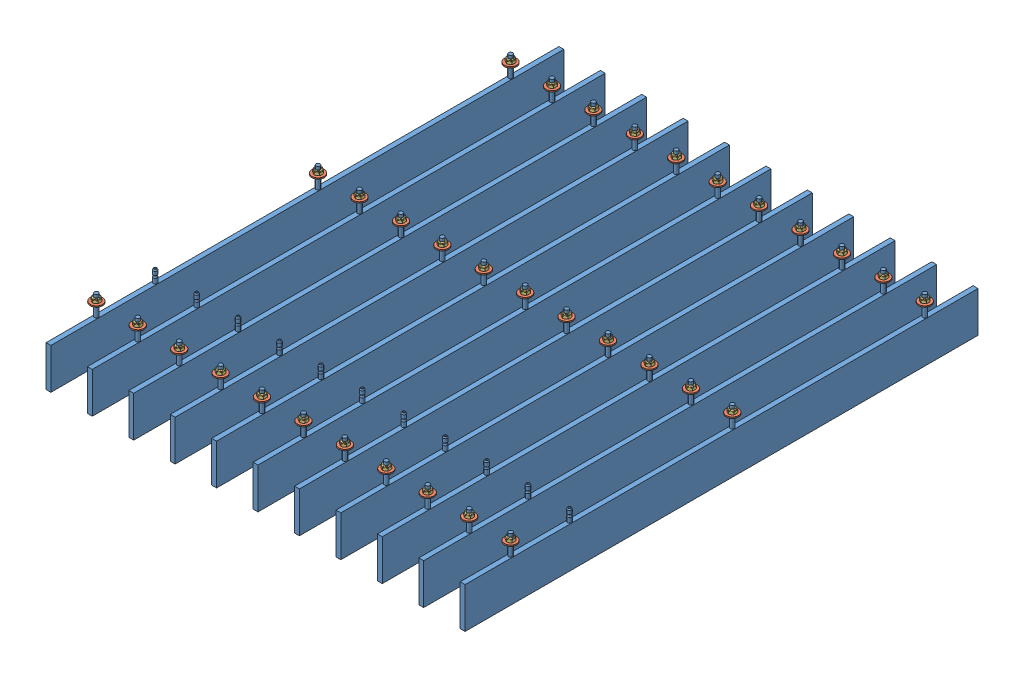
SolidWorks assembly Ensemble coussin.SLDASM, configuration Défaut (file format 4100). Lengths in mm.
Overall size (1050 150 1263).
77 component instances, 3 part files, 11 mates.
Components (placement in the parent):
- Coussin-1: Coussin.SLDPRT [Défaut] at origin size (12 150 1263)
- Rondelle M10 serie Large-1: Rondelle M10 serie Large.SLDPRT [Défaut] at (0 133 125) x (0 0 1) z (0 -1 0) size (30 30 3)
- Rondelle M10 serie Large-2: Rondelle M10 serie Large.SLDPRT [Défaut] at (0 133 599) x (0 0 1) z (0 -1 0) size (30 30 3)
- Rondelle M10 serie Large-3: Rondelle M10 serie Large.SLDPRT [Défaut] at (0 133 1145) x (0 0 1) z (0 -1 0) size (30 30 3)
- Ecrou bague nylon 10-1: Ecrou bague nylon 10.sldprt [Défaut] at (0 133 1145) x (0 1 0) z (-1 0 0) size (10 19.63 17)
- Ecrou bague nylon 10-2: Ecrou bague nylon 10.sldprt [Défaut] at (0 133 599) x (0 1 0) z (-1 0 0) size (10 19.63 17)
- Ecrou bague nylon 10-3: Ecrou bague nylon 10.sldprt [Défaut] at (0 133 125) x (0 1 0) z (-1 0 0) size (10 19.63 17)
- Ecrou bague nylon 10-4: Ecrou bague nylon 10.sldprt [Défaut] at (102 133 125) x (0 1 0) z (-1 0 0) size (10 19.63 17)
- Ecrou bague nylon 10-5: Ecrou bague nylon 10.sldprt [Défaut] at (204 133 125) x (0 1 0) z (-1 0 0) size (10 19.63 17)
- Ecrou bague nylon 10-6: Ecrou bague nylon 10.sldprt [Défaut] at (306 133 125) x (0 1 0) z (-1 0 0) size (10 19.63 17)
- Ecrou bague nylon 10-7: Ecrou bague nylon 10.sldprt [Défaut] at (408 133 125) x (0 1 0) z (-1 0 0) size (10 19.63 17)
- Ecrou bague nylon 10-8: Ecrou bague nylon 10.sldprt [Défaut] at (510 133 125) x (0 1 0) z (-1 0 0) size (10 19.63 17)
- Ecrou bague nylon 10-9: Ecrou bague nylon 10.sldprt [Défaut] at (612 133 125) x (0 1 0) z (-1 0 0) size (10 19.63 17)
- Ecrou bague nylon 10-10: Ecrou bague nylon 10.sldprt [Défaut] at (714 133 125) x (0 1 0) z (-1 0 0) size (10 19.63 17)
- Ecrou bague nylon 10-11: Ecrou bague nylon 10.sldprt [Défaut] at (816 133 125) x (0 1 0) z (-1 0 0) size (10 19.63 17)
- Ecrou bague nylon 10-12: Ecrou bague nylon 10.sldprt [Défaut] at (918 133 125) x (0 1 0) z (-1 0 0) size (10 19.63 17)
- Ecrou bague nylon 10-13: Ecrou bague nylon 10.sldprt [Défaut] at (1020 133 125) x (0 1 0) z (-1 0 0) size (10 19.63 17)
- Ecrou bague nylon 10-14: Ecrou bague nylon 10.sldprt [Défaut] at (102 133 599) x (0 1 0) z (-1 0 0) size (10 19.63 17)
- Ecrou bague nylon 10-15: Ecrou bague nylon 10.sldprt [Défaut] at (204 133 599) x (0 1 0) z (-1 0 0) size (10 19.63 17)
- Ecrou bague nylon 10-16: Ecrou bague nylon 10.sldprt [Défaut] at (306 133 599) x (0 1 0) z (-1 0 0) size (10 19.63 17)
- Ecrou bague nylon 10-17: Ecrou bague nylon 10.sldprt [Défaut] at (408 133 599) x (0 1 0) z (-1 0 0) size (10 19.63 17)
- Ecrou bague nylon 10-18: Ecrou bague nylon 10.sldprt [Défaut] at (510 133 599) x (0 1 0) z (-1 0 0) size (10 19.63 17)
- Ecrou bague nylon 10-19: Ecrou bague nylon 10.sldprt [Défaut] at (612 133 599) x (0 1 0) z (-1 0 0) size (10 19.63 17)
- Ecrou bague nylon 10-20: Ecrou bague nylon 10.sldprt [Défaut] at (714 133 599) x (0 1 0) z (-1 0 0) size (10 19.63 17)
- Ecrou bague nylon 10-21: Ecrou bague nylon 10.sldprt [Défaut] at (816 133 599) x (0 1 0) z (-1 0 0) size (10 19.63 17)
- Ecrou bague nylon 10-22: Ecrou bague nylon 10.sldprt [Défaut] at (918 133 599) x (0 1 0) z (-1 0 0) size (10 19.63 17)
- Ecrou bague nylon 10-23: Ecrou bague nylon 10.sldprt [Défaut] at (1020 133 599) x (0 1 0) z (-1 0 0) size (10 19.63 17)
- Ecrou bague nylon 10-24: Ecrou bague nylon 10.sldprt [Défaut] at (102 133 1145) x (0 1 0) z (-1 0 0) size (10 19.63 17)
- Ecrou bague nylon 10-25: Ecrou bague nylon 10.sldprt [Défaut] at (204 133 1145) x (0 1 0) z (-1 0 0) size (10 19.63 17)
- Ecrou bague nylon 10-26: Ecrou bague nylon 10.sldprt [Défaut] at (306 133 1145) x (0 1 0) z (-1 0 0) size (10 19.63 17)
- Ecrou bague nylon 10-27: Ecrou bague nylon 10.sldprt [Défaut] at (408 133 1145) x (0 1 0) z (-1 0 0) size (10 19.63 17)
- Ecrou bague nylon 10-28: Ecrou bague nylon 10.sldprt [Défaut] at (510 133 1145) x (0 1 0) z (-1 0 0) size (10 19.63 17)
- Ecrou bague nylon 10-29: Ecrou bague nylon 10.sldprt [Défaut] at (612 133 1145) x (0 1 0) z (-1 0 0) size (10 19.63 17)
- Ecrou bague nylon 10-30: Ecrou bague nylon 10.sldprt [Défaut] at (714 133 1145) x (0 1 0) z (-1 0 0) size (10 19.63 17)
- Ecrou bague nylon 10-31: Ecrou bague nylon 10.sldprt [Défaut] at (816 133 1145) x (0 1 0) z (-1 0 0) size (10 19.63 17)
- Ecrou bague nylon 10-32: Ecrou bague nylon 10.sldprt [Défaut] at (918 133 1145) x (0 1 0) z (-1 0 0) size (10 19.63 17)
- Ecrou bague nylon 10-33: Ecrou bague nylon 10.sldprt [Défaut] at (1020 133 1145) x (0 1 0) z (-1 0 0) size (10 19.63 17)
- Rondelle M10 serie Large-4: Rondelle M10 serie Large.SLDPRT [Défaut] at (102 133 1145) x (0 0 1) z (0 -1 0) size (30 30 3)
- Rondelle M10 serie Large-5: Rondelle M10 serie Large.SLDPRT [Défaut] at (204 133 1145) x (0 0 1) z (0 -1 0) size (30 30 3)
- Rondelle M10 serie Large-6: Rondelle M10 serie Large.SLDPRT [Défaut] at (306 133 1145) x (0 0 1) z (0 -1 0) size (30 30 3)
- Rondelle M10 serie Large-7: Rondelle M10 serie Large.SLDPRT [Défaut] at (408 133 1145) x (0 0 1) z (0 -1 0) size (30 30 3)
- Rondelle M10 serie Large-8: Rondelle M10 serie Large.SLDPRT [Défaut] at (510 133 1145) x (0 0 1) z (0 -1 0) size (30 30 3)
- Rondelle M10 serie Large-9: Rondelle M10 serie Large.SLDPRT [Défaut] at (612 133 1145) x (0 0 1) z (0 -1 0) size (30 30 3)
- Rondelle M10 serie Large-10: Rondelle M10 serie Large.SLDPRT [Défaut] at (714 133 1145) x (0 0 1) z (0 -1 0) size (30 30 3)
- Rondelle M10 serie Large-11: Rondelle M10 serie Large.SLDPRT [Défaut] at (816 133 1145) x (0 0 1) z (0 -1 0) size (30 30 3)
- Rondelle M10 serie Large-12: Rondelle M10 serie Large.SLDPRT [Défaut] at (918 133 1145) x (0 0 1) z (0 -1 0) size (30 30 3)
- Rondelle M10 serie Large-13: Rondelle M10 serie Large.SLDPRT [Défaut] at (1020 133 1145) x (0 0 1) z (0 -1 0) size (30 30 3)
- Rondelle M10 serie Large-14: Rondelle M10 serie Large.SLDPRT [Défaut] at (102 133 599) x (0 0 1) z (0 -1 0) size (30 30 3)
- Rondelle M10 serie Large-15: Rondelle M10 serie Large.SLDPRT [Défaut] at (204 133 599) x (0 0 1) z (0 -1 0) size (30 30 3)
- Rondelle M10 serie Large-16: Rondelle M10 serie Large.SLDPRT [Défaut] at (306 133 599) x (0 0 1) z (0 -1 0) size (30 30 3)
- Rondelle M10 serie Large-17: Rondelle M10 serie Large.SLDPRT [Défaut] at (408 133 599) x (0 0 1) z (0 -1 0) size (30 30 3)
- Rondelle M10 serie Large-18: Rondelle M10 serie Large.SLDPRT [Défaut] at (510 133 599) x (0 0 1) z (0 -1 0) size (30 30 3)
- Rondelle M10 serie Large-19: Rondelle M10 serie Large.SLDPRT [Défaut] at (612 133 599) x (0 0 1) z (0 -1 0) size (30 30 3)
- Rondelle M10 serie Large-20: Rondelle M10 serie Large.SLDPRT [Défaut] at (714 133 599) x (0 0 1) z (0 -1 0) size (30 30 3)
- Rondelle M10 serie Large-21: Rondelle M10 serie Large.SLDPRT [Défaut] at (816 133 599) x (0 0 1) z (0 -1 0) size (30 30 3)
- Rondelle M10 serie Large-22: Rondelle M10 serie Large.SLDPRT [Défaut] at (918 133 599) x (0 0 1) z (0 -1 0) size (30 30 3)
- Rondelle M10 serie Large-23: Rondelle M10 serie Large.SLDPRT [Défaut] at (1020 133 599) x (0 0 1) z (0 -1 0) size (30 30 3)
- Rondelle M10 serie Large-24: Rondelle M10 serie Large.SLDPRT [Défaut] at (102 133 125) x (0 0 1) z (0 -1 0) size (30 30 3)
- Rondelle M10 serie Large-25: Rondelle M10 serie Large.SLDPRT [Défaut] at (204 133 125) x (0 0 1) z (0 -1 0) size (30 30 3)
- Rondelle M10 serie Large-26: Rondelle M10 serie Large.SLDPRT [Défaut] at (306 133 125) x (0 0 1) z (0 -1 0) size (30 30 3)
- Rondelle M10 serie Large-27: Rondelle M10 serie Large.SLDPRT [Défaut] at (408 133 125) x (0 0 1) z (0 -1 0) size (30 30 3)
- Rondelle M10 serie Large-28: Rondelle M10 serie Large.SLDPRT [Défaut] at (510 133 125) x (0 0 1) z (0 -1 0) size (30 30 3)
- Rondelle M10 serie Large-29: Rondelle M10 serie Large.SLDPRT [Défaut] at (612 133 125) x (0 0 1) z (0 -1 0) size (30 30 3)
- Rondelle M10 serie Large-30: Rondelle M10 serie Large.SLDPRT [Défaut] at (714 133 125) x (0 0 1) z (0 -1 0) size (30 30 3)
- Rondelle M10 serie Large-31: Rondelle M10 serie Large.SLDPRT [Défaut] at (816 133 125) x (0 0 1) z (0 -1 0) size (30 30 3)
- Rondelle M10 serie Large-32: Rondelle M10 serie Large.SLDPRT [Défaut] at (918 133 125) x (0 0 1) z (0 -1 0) size (30 30 3)
- Rondelle M10 serie Large-33: Rondelle M10 serie Large.SLDPRT [Défaut] at (1020 133 125) x (0 0 1) z (0 -1 0) size (30 30 3)
- Coussin-2: Coussin.SLDPRT [Défaut] at (102 0 0) size (12 150 1263)
- Coussin-3: Coussin.SLDPRT [Défaut] at (204 0 0) size (12 150 1263)
- Coussin-4: Coussin.SLDPRT [Défaut] at (306 0 0) size (12 150 1263)
- Coussin-5: Coussin.SLDPRT [Défaut] at (408 0 0) size (12 150 1263)
- Coussin-6: Coussin.SLDPRT [Défaut] at (510 0 0) size (12 150 1263)
- Coussin-7: Coussin.SLDPRT [Défaut] at (612 0 0) size (12 150 1263)
- Coussin-8: Coussin.SLDPRT [Défaut] at (714 0 0) size (12 150 1263)
- Coussin-9: Coussin.SLDPRT [Défaut] at (816 0 0) size (12 150 1263)
- Coussin-10: Coussin.SLDPRT [Défaut] at (918 0 0) size (12 150 1263)
- Coussin-11: Coussin.SLDPRT [Défaut] at (1020 0 0) size (12 150 1263)
Mates (geometry in assembly coordinates):
- Coaxiale1: concentric anti-aligned: cylinder of Coussin-1 through (0 150 125) axis (0 -1 0) radius 5; cylinder of Rondelle M10 serie Large-1 through (0 130 125) axis (0 1 0) radius 5.25
- Coaxiale2: concentric anti-aligned: cylinder of Coussin-1 through (0 150 599) axis (0 -1 0) radius 5; cylinder of Rondelle M10 serie Large-2 through (0 130 599) axis (0 1 0) radius 5.25
- Coaxiale3: concentric anti-aligned: cylinder of Coussin-1 through (0 150 1145) axis (0 -1 0) radius 5; cylinder of Rondelle M10 serie Large-3 through (0 130 1145) axis (0 1 0) radius 5.25
- Coaxiale4: concentric anti-aligned: cylinder of Coussin-1 through (0 150 125) axis (0 -1 0) radius 5; cylinder of Ecrou bague nylon 10-3 through (0 143 125) axis (0 1 0) radius 4.188
- Coaxiale5: concentric anti-aligned: cylinder of Coussin-1 through (0 150 599) axis (0 -1 0) radius 5; cylinder of Ecrou bague nylon 10-2 through (0 143 599) axis (0 1 0) radius 4.188
- Coaxiale6: concentric anti-aligned: cylinder of Coussin-1 through (0 150 1145) axis (0 -1 0) radius 5; cylinder of Ecrou bague nylon 10-1 through (0 143 1145) axis (0 1 0) radius 4.188
- Coïncidente1: coincident aligned: plane of Rondelle M10 serie Large-1; plane of Rondelle M10 serie Large-2
- Coïncidente2: coincident anti-aligned: plane of Rondelle M10 serie Large-1; plane of Ecrou bague nylon 10-3 through (0 133 116.5) normal (0 -1 0)
- Coïncidente3: coincident aligned: plane of Rondelle M10 serie Large-2; plane of Rondelle M10 serie Large-3
- Coïncidente4: coincident aligned: plane of Ecrou bague nylon 10-1 through (0 133 1136.5) normal (0 -1 0); plane of Ecrou bague nylon 10-2 through (0 133 590.5) normal (0 -1 0)
- Coïncidente5: coincident aligned: plane of Ecrou bague nylon 10-2 through (0 133 590.5) normal (0 -1 0); plane of Ecrou bague nylon 10-3 through (0 133 116.5) normal (0 -1 0)
